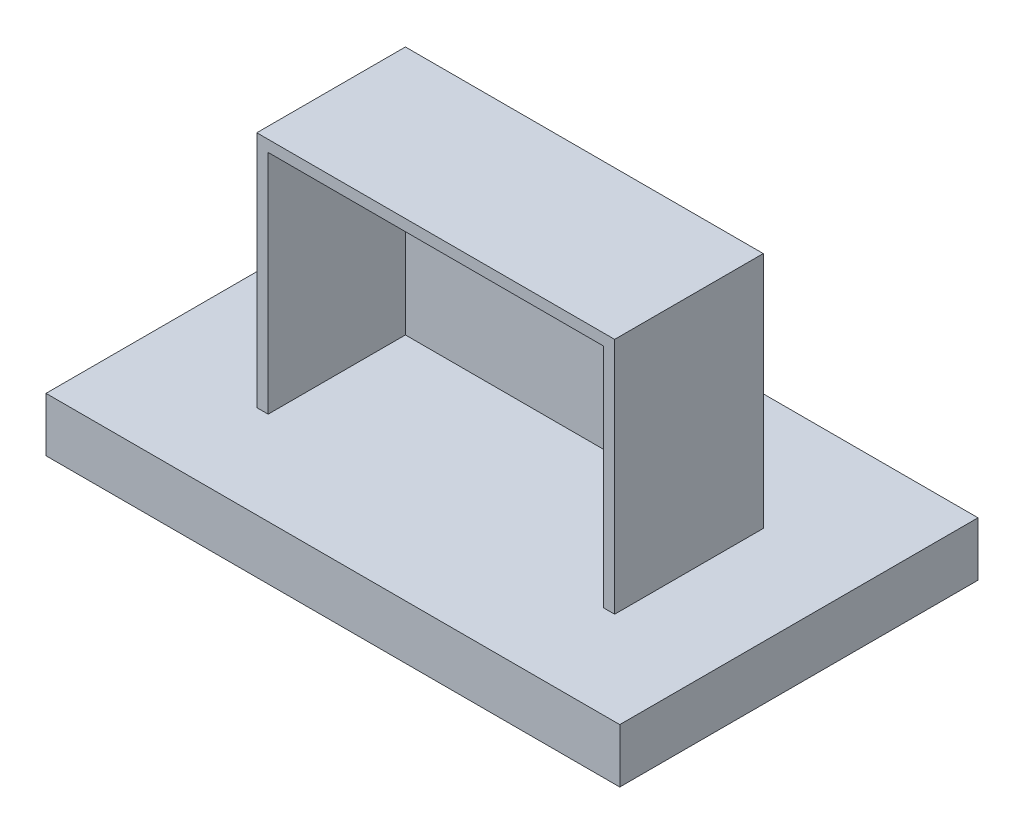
ISO-10303-21;
HEADER;
FILE_DESCRIPTION(('STEP AP214'),'2;1');
FILE_NAME('part.step','',(''),(''),'','','');
FILE_SCHEMA(('AUTOMOTIVE_DESIGN { 1 0 10303 214 1 1 1 1 }'));
ENDSEC;
DATA;
#1=APPLICATION_CONTEXT('core data for automotive mechanical design processes');
#2=APPLICATION_PROTOCOL_DEFINITION('international standard','automotive_design',2000,#1);
#3=PRODUCT_CONTEXT('',#1,'mechanical');
#4=PRODUCT('Part','Part','',(#3));
#5=PRODUCT_RELATED_PRODUCT_CATEGORY('part','',(#4));
#6=PRODUCT_DEFINITION_FORMATION('','',#4);
#7=PRODUCT_DEFINITION_CONTEXT('part definition',#1,'design');
#8=PRODUCT_DEFINITION('design','',#6,#7);
#9=PRODUCT_DEFINITION_SHAPE('','',#8);
#10=(LENGTH_UNIT() NAMED_UNIT(*) SI_UNIT(.MILLI.,.METRE.));
#11=(NAMED_UNIT(*) PLANE_ANGLE_UNIT() SI_UNIT($,.RADIAN.));
#12=(NAMED_UNIT(*) SI_UNIT($,.STERADIAN.) SOLID_ANGLE_UNIT());
#13=UNCERTAINTY_MEASURE_WITH_UNIT(LENGTH_MEASURE(1.E-05),#10,'distance_accuracy_value','');
#14=(GEOMETRIC_REPRESENTATION_CONTEXT(3) GLOBAL_UNCERTAINTY_ASSIGNED_CONTEXT((#13)) GLOBAL_UNIT_ASSIGNED_CONTEXT((#10,
#11,#12)) REPRESENTATION_CONTEXT('',''));
#15=CARTESIAN_POINT('',(0.,0.,0.));
#16=DIRECTION('',(0.,0.,1.));
#17=DIRECTION('',(1.,0.,0.));
#18=AXIS2_PLACEMENT_3D('',#15,#16,#17);
#19=CARTESIAN_POINT('',(26.3405968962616,65.3386815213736,-54.0423788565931));
#20=DIRECTION('',(1.,0.,0.));
#21=DIRECTION('',(0.,0.,-1.));
#22=AXIS2_PLACEMENT_3D('',#19,#20,#21);
#23=PLANE('',#22);
#24=DIRECTION('',(0.,0.,1.));
#25=VECTOR('',#24,1.);
#26=CARTESIAN_POINT('',(26.3405968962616,12.0953407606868,-54.0423788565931));
#27=LINE('',#26,#25);
#28=CARTESIAN_POINT('',(26.3405968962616,12.0953407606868,-54.0423788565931));
#29=VERTEX_POINT('',#28);
#30=CARTESIAN_POINT('',(26.3405968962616,12.0953407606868,-20.8056990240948));
#31=VERTEX_POINT('',#30);
#32=EDGE_CURVE('E138',#29,#31,#27,.T.);
#33=ORIENTED_EDGE('',*,*,#32,.T.);
#34=DIRECTION('',(0.,-1.,0.));
#35=VECTOR('',#34,1.);
#36=CARTESIAN_POINT('',(26.3405968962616,65.3386815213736,-20.8056990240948));
#37=LINE('',#36,#35);
#38=CARTESIAN_POINT('',(26.3405968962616,65.3386815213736,-20.8056990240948));
#39=VERTEX_POINT('',#38);
#40=EDGE_CURVE('E12',#39,#31,#37,.T.);
#41=ORIENTED_EDGE('',*,*,#40,.F.);
#42=DIRECTION('',(0.,0.,1.));
#43=VECTOR('',#42,1.);
#44=CARTESIAN_POINT('',(26.3405968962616,65.3386815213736,-54.0423788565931));
#45=LINE('',#44,#43);
#46=CARTESIAN_POINT('',(26.3405968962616,65.3386815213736,-54.0423788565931));
#47=VERTEX_POINT('',#46);
#48=EDGE_CURVE('E149',#47,#39,#45,.T.);
#49=ORIENTED_EDGE('',*,*,#48,.F.);
#50=DIRECTION('',(0.,-1.,0.));
#51=VECTOR('',#50,1.);
#52=CARTESIAN_POINT('',(26.3405968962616,65.3386815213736,-54.0423788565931));
#53=LINE('',#52,#51);
#54=EDGE_CURVE('E156',#47,#29,#53,.T.);
#55=ORIENTED_EDGE('',*,*,#54,.T.);
#56=EDGE_LOOP('',(#33,#41,#49,#55));
#57=FACE_BOUND('',#56,.T.);
#58=ADVANCED_FACE('F37',(#57),#23,.F.);
#59=CARTESIAN_POINT('',(26.3405968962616,65.3386815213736,-20.8056990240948));
#60=DIRECTION('',(0.,0.,-1.));
#61=DIRECTION('',(-1.,0.,0.));
#62=AXIS2_PLACEMENT_3D('',#59,#60,#61);
#63=PLANE('',#62);
#64=DIRECTION('',(1.,0.,0.));
#65=VECTOR('',#64,1.);
#66=CARTESIAN_POINT('',(26.3405968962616,62.7986815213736,-20.8056990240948));
#67=LINE('',#66,#65);
#68=CARTESIAN_POINT('',(28.8805968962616,62.7986815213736,-20.8056990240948));
#69=VERTEX_POINT('',#68);
#70=CARTESIAN_POINT('',(103.839551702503,62.7986815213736,-20.8056990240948));
#71=VERTEX_POINT('',#70);
#72=EDGE_CURVE('E122',#69,#71,#67,.T.);
#73=ORIENTED_EDGE('',*,*,#72,.T.);
#74=DIRECTION('',(0.,-1.,0.));
#75=VECTOR('',#74,1.);
#76=CARTESIAN_POINT('',(103.839551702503,65.3386815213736,-20.8056990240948));
#77=LINE('',#76,#75);
#78=CARTESIAN_POINT('',(103.839551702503,12.0953407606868,-20.8056990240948));
#79=VERTEX_POINT('',#78);
#80=EDGE_CURVE('E129',#71,#79,#77,.T.);
#81=ORIENTED_EDGE('',*,*,#80,.T.);
#82=DIRECTION('',(1.,0.,0.));
#83=VECTOR('',#82,1.);
#84=CARTESIAN_POINT('',(26.3405968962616,12.0953407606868,-20.8056990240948));
#85=LINE('',#84,#83);
#86=CARTESIAN_POINT('',(106.379551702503,12.0953407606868,-20.8056990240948));
#87=VERTEX_POINT('',#86);
#88=EDGE_CURVE('E141',#79,#87,#85,.T.);
#89=ORIENTED_EDGE('',*,*,#88,.T.);
#90=DIRECTION('',(0.,-1.,0.));
#91=VECTOR('',#90,1.);
#92=CARTESIAN_POINT('',(106.379551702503,65.3386815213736,-20.8056990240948));
#93=LINE('',#92,#91);
#94=CARTESIAN_POINT('',(106.379551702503,65.3386815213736,-20.8056990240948));
#95=VERTEX_POINT('',#94);
#96=EDGE_CURVE('E44',#95,#87,#93,.T.);
#97=ORIENTED_EDGE('',*,*,#96,.F.);
#98=DIRECTION('',(1.,0.,0.));
#99=VECTOR('',#98,1.);
#100=CARTESIAN_POINT('',(26.3405968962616,65.3386815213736,-20.8056990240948));
#101=LINE('',#100,#99);
#102=EDGE_CURVE('E151',#39,#95,#101,.T.);
#103=ORIENTED_EDGE('',*,*,#102,.F.);
#104=ORIENTED_EDGE('',*,*,#40,.T.);
#105=CARTESIAN_POINT('',(28.8805968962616,12.0953407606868,-20.8056990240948));
#106=VERTEX_POINT('',#105);
#107=EDGE_CURVE('E142',#31,#106,#85,.T.);
#108=ORIENTED_EDGE('',*,*,#107,.T.);
#109=DIRECTION('',(0.,-1.,0.));
#110=VECTOR('',#109,1.);
#111=CARTESIAN_POINT('',(28.8805968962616,65.3386815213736,-20.8056990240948));
#112=LINE('',#111,#110);
#113=EDGE_CURVE('E135',#69,#106,#112,.T.);
#114=ORIENTED_EDGE('',*,*,#113,.F.);
#115=EDGE_LOOP('',(#73,#81,#89,#97,#103,#104,#108,#114));
#116=FACE_BOUND('',#115,.T.);
#117=ADVANCED_FACE('F180',(#116),#63,.F.);
#118=CARTESIAN_POINT('',(106.379551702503,65.3386815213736,-54.0423788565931));
#119=DIRECTION('',(-1.,0.,0.));
#120=DIRECTION('',(0.,0.,1.));
#121=AXIS2_PLACEMENT_3D('',#118,#119,#120);
#122=PLANE('',#121);
#123=DIRECTION('',(0.,0.,-1.));
#124=VECTOR('',#123,1.);
#125=CARTESIAN_POINT('',(106.379551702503,12.0953407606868,-54.0423788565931));
#126=LINE('',#125,#124);
#127=CARTESIAN_POINT('',(106.379551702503,12.0953407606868,-54.0423788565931));
#128=VERTEX_POINT('',#127);
#129=EDGE_CURVE('E145',#87,#128,#126,.T.);
#130=ORIENTED_EDGE('',*,*,#129,.T.);
#131=DIRECTION('',(0.,-1.,0.));
#132=VECTOR('',#131,1.);
#133=CARTESIAN_POINT('',(106.379551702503,65.3386815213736,-54.0423788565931));
#134=LINE('',#133,#132);
#135=CARTESIAN_POINT('',(106.379551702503,65.3386815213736,-54.0423788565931));
#136=VERTEX_POINT('',#135);
#137=EDGE_CURVE('E159',#136,#128,#134,.T.);
#138=ORIENTED_EDGE('',*,*,#137,.F.);
#139=DIRECTION('',(0.,0.,-1.));
#140=VECTOR('',#139,1.);
#141=CARTESIAN_POINT('',(106.379551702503,65.3386815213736,-54.0423788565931));
#142=LINE('',#141,#140);
#143=EDGE_CURVE('E153',#95,#136,#142,.T.);
#144=ORIENTED_EDGE('',*,*,#143,.F.);
#145=ORIENTED_EDGE('',*,*,#96,.T.);
#146=EDGE_LOOP('',(#130,#138,#144,#145));
#147=FACE_BOUND('',#146,.T.);
#148=ADVANCED_FACE('F166',(#147),#122,.F.);
#149=CARTESIAN_POINT('',(26.3405968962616,65.3386815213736,-54.0423788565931));
#150=DIRECTION('',(0.,0.,1.));
#151=DIRECTION('',(1.,0.,0.));
#152=AXIS2_PLACEMENT_3D('',#149,#150,#151);
#153=PLANE('',#152);
#154=DIRECTION('',(-1.,0.,0.));
#155=VECTOR('',#154,1.);
#156=CARTESIAN_POINT('',(26.3405968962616,12.0953407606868,-54.0423788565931));
#157=LINE('',#156,#155);
#158=EDGE_CURVE('E147',#128,#29,#157,.T.);
#159=ORIENTED_EDGE('',*,*,#158,.T.);
#160=ORIENTED_EDGE('',*,*,#54,.F.);
#161=DIRECTION('',(-1.,0.,0.));
#162=VECTOR('',#161,1.);
#163=CARTESIAN_POINT('',(26.3405968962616,65.3386815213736,-54.0423788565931));
#164=LINE('',#163,#162);
#165=EDGE_CURVE('E59',#136,#47,#164,.T.);
#166=ORIENTED_EDGE('',*,*,#165,.F.);
#167=ORIENTED_EDGE('',*,*,#137,.T.);
#168=EDGE_LOOP('',(#159,#160,#166,#167));
#169=FACE_BOUND('',#168,.T.);
#170=ADVANCED_FACE('F175',(#169),#153,.F.);
#171=CARTESIAN_POINT('',(26.3405968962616,65.3386815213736,-20.8056990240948));
#172=DIRECTION('',(0.,1.,0.));
#173=DIRECTION('',(0.,0.,1.));
#174=AXIS2_PLACEMENT_3D('',#171,#172,#173);
#175=PLANE('',#174);
#176=ORIENTED_EDGE('',*,*,#48,.T.);
#177=ORIENTED_EDGE('',*,*,#102,.T.);
#178=ORIENTED_EDGE('',*,*,#143,.T.);
#179=ORIENTED_EDGE('',*,*,#165,.T.);
#180=EDGE_LOOP('',(#176,#177,#178,#179));
#181=FACE_BOUND('',#180,.T.);
#182=ADVANCED_FACE('F179',(#181),#175,.T.);
#183=CARTESIAN_POINT('',(26.3405968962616,12.0953407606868,-20.8056990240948));
#184=DIRECTION('',(0.,1.,0.));
#185=DIRECTION('',(0.,0.,1.));
#186=AXIS2_PLACEMENT_3D('',#183,#184,#185);
#187=PLANE('',#186);
#188=DIRECTION('',(-1.,0.,0.));
#189=VECTOR('',#188,1.);
#190=CARTESIAN_POINT('',(26.3405968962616,12.0953407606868,-51.5023788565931));
#191=LINE('',#190,#189);
#192=CARTESIAN_POINT('',(103.839551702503,12.0953407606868,-51.5023788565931));
#193=VERTEX_POINT('',#192);
#194=CARTESIAN_POINT('',(28.8805968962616,12.0953407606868,-51.5023788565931));
#195=VERTEX_POINT('',#194);
#196=EDGE_CURVE('E51',#193,#195,#191,.T.);
#197=ORIENTED_EDGE('',*,*,#196,.T.);
#198=DIRECTION('',(0.,0.,1.));
#199=VECTOR('',#198,1.);
#200=CARTESIAN_POINT('',(28.8805968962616,12.0953407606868,-54.0423788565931));
#201=LINE('',#200,#199);
#202=EDGE_CURVE('E118',#195,#106,#201,.T.);
#203=ORIENTED_EDGE('',*,*,#202,.T.);
#204=ORIENTED_EDGE('',*,*,#107,.F.);
#205=ORIENTED_EDGE('',*,*,#32,.F.);
#206=ORIENTED_EDGE('',*,*,#158,.F.);
#207=ORIENTED_EDGE('',*,*,#129,.F.);
#208=ORIENTED_EDGE('',*,*,#88,.F.);
#209=DIRECTION('',(0.,0.,-1.));
#210=VECTOR('',#209,1.);
#211=CARTESIAN_POINT('',(103.839551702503,12.0953407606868,-54.0423788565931));
#212=LINE('',#211,#210);
#213=EDGE_CURVE('E125',#79,#193,#212,.T.);
#214=ORIENTED_EDGE('',*,*,#213,.T.);
#215=EDGE_LOOP('',(#197,#203,#204,#205,#206,#207,#208,#214));
#216=FACE_BOUND('',#215,.T.);
#217=ADVANCED_FACE('F172',(#216),#187,.F.);
#218=CARTESIAN_POINT('',(28.8805968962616,65.3386815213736,-54.0423788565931));
#219=DIRECTION('',(1.,0.,0.));
#220=DIRECTION('',(0.,0.,-1.));
#221=AXIS2_PLACEMENT_3D('',#218,#219,#220);
#222=PLANE('',#221);
#223=ORIENTED_EDGE('',*,*,#202,.F.);
#224=DIRECTION('',(0.,-1.,0.));
#225=VECTOR('',#224,1.);
#226=CARTESIAN_POINT('',(28.8805968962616,65.3386815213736,-51.5023788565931));
#227=LINE('',#226,#225);
#228=CARTESIAN_POINT('',(28.8805968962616,62.7986815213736,-51.5023788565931));
#229=VERTEX_POINT('',#228);
#230=EDGE_CURVE('E104',#229,#195,#227,.T.);
#231=ORIENTED_EDGE('',*,*,#230,.F.);
#232=DIRECTION('',(0.,0.,1.));
#233=VECTOR('',#232,1.);
#234=CARTESIAN_POINT('',(28.8805968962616,62.7986815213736,-54.0423788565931));
#235=LINE('',#234,#233);
#236=EDGE_CURVE('E115',#229,#69,#235,.T.);
#237=ORIENTED_EDGE('',*,*,#236,.T.);
#238=ORIENTED_EDGE('',*,*,#113,.T.);
#239=EDGE_LOOP('',(#223,#231,#237,#238));
#240=FACE_BOUND('',#239,.T.);
#241=ADVANCED_FACE('F114',(#240),#222,.T.);
#242=CARTESIAN_POINT('',(103.839551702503,65.3386815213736,-54.0423788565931));
#243=DIRECTION('',(-1.,0.,0.));
#244=DIRECTION('',(0.,0.,1.));
#245=AXIS2_PLACEMENT_3D('',#242,#243,#244);
#246=PLANE('',#245);
#247=ORIENTED_EDGE('',*,*,#213,.F.);
#248=ORIENTED_EDGE('',*,*,#80,.F.);
#249=DIRECTION('',(0.,0.,-1.));
#250=VECTOR('',#249,1.);
#251=CARTESIAN_POINT('',(103.839551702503,62.7986815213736,-54.0423788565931));
#252=LINE('',#251,#250);
#253=CARTESIAN_POINT('',(103.839551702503,62.7986815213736,-51.5023788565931));
#254=VERTEX_POINT('',#253);
#255=EDGE_CURVE('E110',#71,#254,#252,.T.);
#256=ORIENTED_EDGE('',*,*,#255,.T.);
#257=DIRECTION('',(0.,-1.,0.));
#258=VECTOR('',#257,1.);
#259=CARTESIAN_POINT('',(103.839551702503,65.3386815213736,-51.5023788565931));
#260=LINE('',#259,#258);
#261=EDGE_CURVE('E106',#254,#193,#260,.T.);
#262=ORIENTED_EDGE('',*,*,#261,.T.);
#263=EDGE_LOOP('',(#247,#248,#256,#262));
#264=FACE_BOUND('',#263,.T.);
#265=ADVANCED_FACE('F182',(#264),#246,.T.);
#266=CARTESIAN_POINT('',(26.3405968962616,65.3386815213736,-51.5023788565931));
#267=DIRECTION('',(0.,0.,1.));
#268=DIRECTION('',(1.,0.,0.));
#269=AXIS2_PLACEMENT_3D('',#266,#267,#268);
#270=PLANE('',#269);
#271=ORIENTED_EDGE('',*,*,#196,.F.);
#272=ORIENTED_EDGE('',*,*,#261,.F.);
#273=DIRECTION('',(-1.,0.,0.));
#274=VECTOR('',#273,1.);
#275=CARTESIAN_POINT('',(26.3405968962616,62.7986815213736,-51.5023788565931));
#276=LINE('',#275,#274);
#277=EDGE_CURVE('E101',#254,#229,#276,.T.);
#278=ORIENTED_EDGE('',*,*,#277,.T.);
#279=ORIENTED_EDGE('',*,*,#230,.T.);
#280=EDGE_LOOP('',(#271,#272,#278,#279));
#281=FACE_BOUND('',#280,.T.);
#282=ADVANCED_FACE('F103',(#281),#270,.T.);
#283=CARTESIAN_POINT('',(26.3405968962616,62.7986815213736,-20.8056990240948));
#284=DIRECTION('',(0.,1.,0.));
#285=DIRECTION('',(0.,0.,1.));
#286=AXIS2_PLACEMENT_3D('',#283,#284,#285);
#287=PLANE('',#286);
#288=ORIENTED_EDGE('',*,*,#236,.F.);
#289=ORIENTED_EDGE('',*,*,#277,.F.);
#290=ORIENTED_EDGE('',*,*,#255,.F.);
#291=ORIENTED_EDGE('',*,*,#72,.F.);
#292=EDGE_LOOP('',(#288,#289,#290,#291));
#293=FACE_BOUND('',#292,.T.);
#294=ADVANCED_FACE('F120',(#293),#287,.F.);
#295=CLOSED_SHELL('',(#58,#117,#148,#170,#182,#217,#241,#265,#282,#294));
#296=MANIFOLD_SOLID_BREP('B2',#295);
#297=CARTESIAN_POINT('',(0.,12.0953407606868,0.));
#298=DIRECTION('',(1.,0.,0.));
#299=DIRECTION('',(0.,0.,-1.));
#300=AXIS2_PLACEMENT_3D('',#297,#298,#299);
#301=PLANE('',#300);
#302=DIRECTION('',(0.,0.,1.));
#303=VECTOR('',#302,1.);
#304=CARTESIAN_POINT('',(0.,0.,0.));
#305=LINE('',#304,#303);
#306=CARTESIAN_POINT('',(0.,0.,-80.1222591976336));
#307=VERTEX_POINT('',#306);
#308=CARTESIAN_POINT('',(0.,0.,0.));
#309=VERTEX_POINT('',#308);
#310=EDGE_CURVE('E287',#307,#309,#305,.T.);
#311=ORIENTED_EDGE('',*,*,#310,.T.);
#312=DIRECTION('',(0.,-1.,0.));
#313=VECTOR('',#312,1.);
#314=CARTESIAN_POINT('',(0.,12.0953407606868,0.));
#315=LINE('',#314,#313);
#316=CARTESIAN_POINT('',(0.,12.0953407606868,0.));
#317=VERTEX_POINT('',#316);
#318=EDGE_CURVE('E35',#317,#309,#315,.T.);
#319=ORIENTED_EDGE('',*,*,#318,.F.);
#320=DIRECTION('',(0.,0.,1.));
#321=VECTOR('',#320,1.);
#322=CARTESIAN_POINT('',(0.,12.0953407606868,0.));
#323=LINE('',#322,#321);
#324=CARTESIAN_POINT('',(0.,12.0953407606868,-80.1222591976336));
#325=VERTEX_POINT('',#324);
#326=EDGE_CURVE('E305',#325,#317,#323,.T.);
#327=ORIENTED_EDGE('',*,*,#326,.F.);
#328=DIRECTION('',(0.,-1.,0.));
#329=VECTOR('',#328,1.);
#330=CARTESIAN_POINT('',(0.,12.0953407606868,-80.1222591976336));
#331=LINE('',#330,#329);
#332=EDGE_CURVE('E299',#325,#307,#331,.T.);
#333=ORIENTED_EDGE('',*,*,#332,.T.);
#334=EDGE_LOOP('',(#311,#319,#327,#333));
#335=FACE_BOUND('',#334,.T.);
#336=ADVANCED_FACE('F243',(#335),#301,.F.);
#337=CARTESIAN_POINT('',(0.,12.0953407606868,0.));
#338=DIRECTION('',(0.,0.,-1.));
#339=DIRECTION('',(-1.,0.,0.));
#340=AXIS2_PLACEMENT_3D('',#337,#338,#339);
#341=PLANE('',#340);
#342=DIRECTION('',(1.,0.,0.));
#343=VECTOR('',#342,1.);
#344=CARTESIAN_POINT('',(0.,0.,0.));
#345=LINE('',#344,#343);
#346=CARTESIAN_POINT('',(128.32723239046,0.,0.));
#347=VERTEX_POINT('',#346);
#348=EDGE_CURVE('E283',#309,#347,#345,.T.);
#349=ORIENTED_EDGE('',*,*,#348,.T.);
#350=DIRECTION('',(0.,-1.,0.));
#351=VECTOR('',#350,1.);
#352=CARTESIAN_POINT('',(128.32723239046,12.0953407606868,0.));
#353=LINE('',#352,#351);
#354=CARTESIAN_POINT('',(128.32723239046,12.0953407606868,0.));
#355=VERTEX_POINT('',#354);
#356=EDGE_CURVE('E250',#355,#347,#353,.T.);
#357=ORIENTED_EDGE('',*,*,#356,.F.);
#358=DIRECTION('',(1.,0.,0.));
#359=VECTOR('',#358,1.);
#360=CARTESIAN_POINT('',(0.,12.0953407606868,0.));
#361=LINE('',#360,#359);
#362=EDGE_CURVE('E295',#317,#355,#361,.T.);
#363=ORIENTED_EDGE('',*,*,#362,.F.);
#364=ORIENTED_EDGE('',*,*,#318,.T.);
#365=EDGE_LOOP('',(#349,#357,#363,#364));
#366=FACE_BOUND('',#365,.T.);
#367=ADVANCED_FACE('F294',(#366),#341,.F.);
#368=CARTESIAN_POINT('',(128.32723239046,12.0953407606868,0.));
#369=DIRECTION('',(-1.,0.,0.));
#370=DIRECTION('',(0.,0.,1.));
#371=AXIS2_PLACEMENT_3D('',#368,#369,#370);
#372=PLANE('',#371);
#373=DIRECTION('',(0.,0.,-1.));
#374=VECTOR('',#373,1.);
#375=CARTESIAN_POINT('',(128.32723239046,0.,0.));
#376=LINE('',#375,#374);
#377=CARTESIAN_POINT('',(128.32723239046,0.,-80.1222591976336));
#378=VERTEX_POINT('',#377);
#379=EDGE_CURVE('E288',#347,#378,#376,.T.);
#380=ORIENTED_EDGE('',*,*,#379,.T.);
#381=DIRECTION('',(0.,-1.,0.));
#382=VECTOR('',#381,1.);
#383=CARTESIAN_POINT('',(128.32723239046,12.0953407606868,-80.1222591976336));
#384=LINE('',#383,#382);
#385=CARTESIAN_POINT('',(128.32723239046,12.0953407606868,-80.1222591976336));
#386=VERTEX_POINT('',#385);
#387=EDGE_CURVE('E311',#386,#378,#384,.T.);
#388=ORIENTED_EDGE('',*,*,#387,.F.);
#389=DIRECTION('',(0.,0.,-1.));
#390=VECTOR('',#389,1.);
#391=CARTESIAN_POINT('',(128.32723239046,12.0953407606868,0.));
#392=LINE('',#391,#390);
#393=EDGE_CURVE('E262',#355,#386,#392,.T.);
#394=ORIENTED_EDGE('',*,*,#393,.F.);
#395=ORIENTED_EDGE('',*,*,#356,.T.);
#396=EDGE_LOOP('',(#380,#388,#394,#395));
#397=FACE_BOUND('',#396,.T.);
#398=ADVANCED_FACE('F314',(#397),#372,.F.);
#399=CARTESIAN_POINT('',(0.,12.0953407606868,-80.1222591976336));
#400=DIRECTION('',(0.,0.,1.));
#401=DIRECTION('',(1.,0.,0.));
#402=AXIS2_PLACEMENT_3D('',#399,#400,#401);
#403=PLANE('',#402);
#404=DIRECTION('',(-1.,0.,0.));
#405=VECTOR('',#404,1.);
#406=CARTESIAN_POINT('',(0.,0.,-80.1222591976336));
#407=LINE('',#406,#405);
#408=EDGE_CURVE('E303',#378,#307,#407,.T.);
#409=ORIENTED_EDGE('',*,*,#408,.T.);
#410=ORIENTED_EDGE('',*,*,#332,.F.);
#411=DIRECTION('',(-1.,0.,0.));
#412=VECTOR('',#411,1.);
#413=CARTESIAN_POINT('',(0.,12.0953407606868,-80.1222591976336));
#414=LINE('',#413,#412);
#415=EDGE_CURVE('E257',#386,#325,#414,.T.);
#416=ORIENTED_EDGE('',*,*,#415,.F.);
#417=ORIENTED_EDGE('',*,*,#387,.T.);
#418=EDGE_LOOP('',(#409,#410,#416,#417));
#419=FACE_BOUND('',#418,.T.);
#420=ADVANCED_FACE('F316',(#419),#403,.F.);
#421=CARTESIAN_POINT('',(0.,12.0953407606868,-80.1222591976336));
#422=DIRECTION('',(0.,-1.,0.));
#423=DIRECTION('',(0.,0.,-1.));
#424=AXIS2_PLACEMENT_3D('',#421,#422,#423);
#425=PLANE('',#424);
#426=ORIENTED_EDGE('',*,*,#326,.T.);
#427=ORIENTED_EDGE('',*,*,#362,.T.);
#428=ORIENTED_EDGE('',*,*,#393,.T.);
#429=ORIENTED_EDGE('',*,*,#415,.T.);
#430=EDGE_LOOP('',(#426,#427,#428,#429));
#431=FACE_BOUND('',#430,.T.);
#432=ADVANCED_FACE('F317',(#431),#425,.F.);
#433=CARTESIAN_POINT('',(0.,0.,-80.1222591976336));
#434=DIRECTION('',(0.,-1.,0.));
#435=DIRECTION('',(0.,0.,-1.));
#436=AXIS2_PLACEMENT_3D('',#433,#434,#435);
#437=PLANE('',#436);
#438=ORIENTED_EDGE('',*,*,#310,.F.);
#439=ORIENTED_EDGE('',*,*,#408,.F.);
#440=ORIENTED_EDGE('',*,*,#379,.F.);
#441=ORIENTED_EDGE('',*,*,#348,.F.);
#442=EDGE_LOOP('',(#438,#439,#440,#441));
#443=FACE_BOUND('',#442,.T.);
#444=ADVANCED_FACE('F284',(#443),#437,.T.);
#445=CLOSED_SHELL('',(#336,#367,#398,#420,#432,#444));
#446=MANIFOLD_SOLID_BREP('B6',#445);
#447=ADVANCED_BREP_SHAPE_REPRESENTATION('',(#18,#296,#446),#14);
#448=SHAPE_DEFINITION_REPRESENTATION(#9,#447);
ENDSEC;
END-ISO-10303-21;
